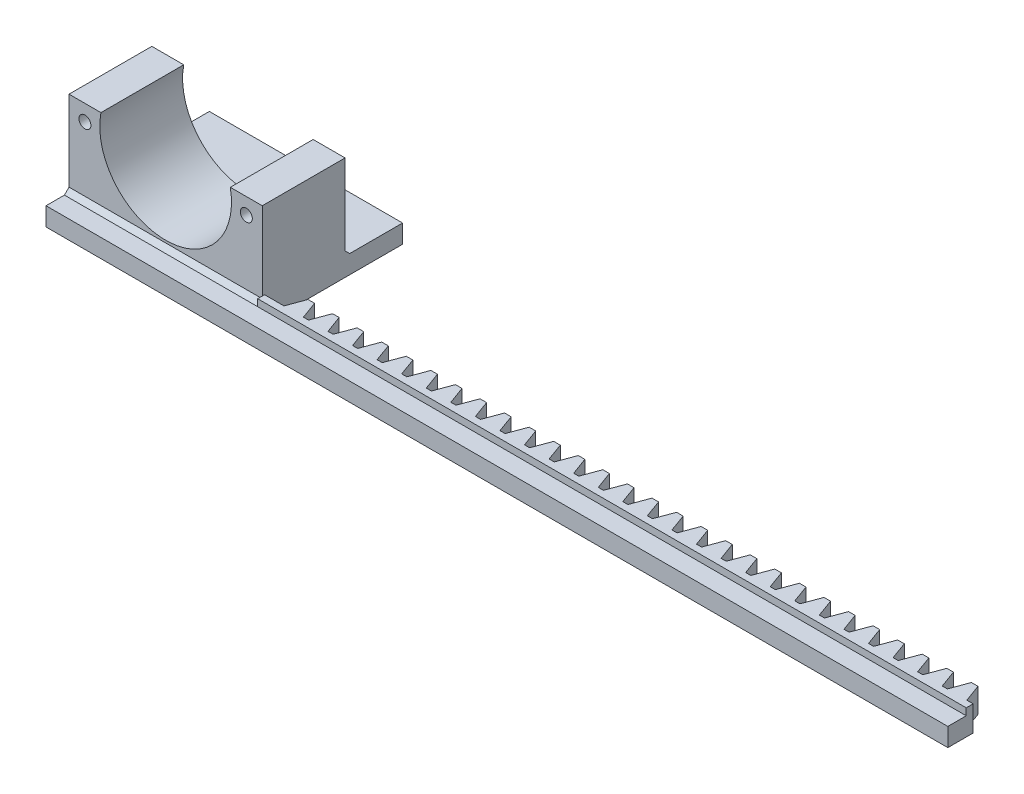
from build123d import *

# Parameters (mm, degrees)
BOSS_EXTRUDE1_DEPTH = 2.64
SKETCH2_W           = 154
SKETCH2_H           = 1.5
BOSS_EXTRUDE2_DEPTH = 0.22
SKETCH3_W           = 4
SKETCH3_H           = 4
BOSS_EXTRUDE3_DEPTH = 154
SKETCH4_W           = 42
SKETCH4_H           = 35.5
BOSS_EXTRUDE4_DEPTH = 4
SKETCH6_W           = 42
SKETCH6_H           = 18
BOSS_EXTRUDE5_DEPTH = 18.5
SKETCH7_R           = 14.314223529
CUT_EXTRUDE1_DEPTH  = 18.5
BOSS_EXTRUDE6_START = -42
BOSS_EXTRUDE6_DEPTH = 42
SKETCH9_R           = 1.3
CUT_EXTRUDE2_DEPTH  = 18.5


with BuildPart() as part:
    # Sketch1 → Boss-Extrude1 (new, symmetric)
    with BuildSketch(Plane(origin=(0, 0, 0), x_dir=(1, 0, 0), z_dir=(0, 1, 0))):
        Polygon((25, 1.7), (23.567498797, 1.7), (22.161556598, -2.125), (17.948749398, -2.125), (17.948749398, -3.625), (171.948749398, -3.625), (171.948749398, -2.125), (170.572186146, -2.125), (169.18, 1.7), (167.747498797, 1.7), (166.341556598, -2.125), (165.232186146, -2.125), (163.84, 1.7), (162.407498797, 1.7), (161.001556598, -2.125), (159.892186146, -2.125), (158.5, 1.7), (157.067498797, 1.7), (155.661556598, -2.125), (154.552186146, -2.125), (153.16, 1.7), (151.727498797, 1.7), (150.321556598, -2.125), (149.212186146, -2.125), (147.82, 1.7), (146.387498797, 1.7), (144.981556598, -2.125), (143.872186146, -2.125), (142.48, 1.7), (141.047498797, 1.7), (139.641556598, -2.125), (138.532186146, -2.125), (137.14, 1.7), (135.707498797, 1.7), (134.301556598, -2.125), (133.192186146, -2.125), (131.8, 1.7), (130.367498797, 1.7), (128.961556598, -2.125), (127.852186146, -2.125), (126.46, 1.7), (125.027498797, 1.7), (123.621556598, -2.125), (122.512186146, -2.125), (121.12, 1.7), (119.687498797, 1.7), (118.281556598, -2.125), (117.172186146, -2.125), (115.78, 1.7), (114.347498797, 1.7), (112.941556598, -2.125), (111.832186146, -2.125), (110.44, 1.7), (109.007498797, 1.7), (107.601556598, -2.125), (106.492186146, -2.125), (105.1, 1.7), (103.667498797, 1.7), (102.261556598, -2.125), (101.152186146, -2.125), (99.76, 1.7), (98.327498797, 1.7), (96.921556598, -2.125), (95.812186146, -2.125), (94.42, 1.7), (92.987498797, 1.7), (91.581556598, -2.125), (90.472186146, -2.125), (89.08, 1.7), (87.647498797, 1.7), (86.241556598, -2.125), (85.132186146, -2.125), (83.74, 1.7), (82.307498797, 1.7), (80.901556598, -2.125), (79.792186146, -2.125), (78.4, 1.7), (76.967498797, 1.7), (75.561556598, -2.125), (74.452186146, -2.125), (73.06, 1.7), (71.627498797, 1.7), (70.221556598, -2.125), (69.112186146, -2.125), (67.72, 1.7), (66.287498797, 1.7), (64.881556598, -2.125), (63.772186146, -2.125), (62.38, 1.7), (60.947498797, 1.7), (59.541556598, -2.125), (58.432186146, -2.125), (57.04, 1.7), (55.607498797, 1.7), (54.201556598, -2.125), (53.092186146, -2.125), (51.7, 1.7), (50.267498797, 1.7), (48.861556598, -2.125), (47.752186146, -2.125), (46.36, 1.7), (44.927498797, 1.7), (43.521556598, -2.125), (42.412186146, -2.125), (41.02, 1.7), (39.587498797, 1.7), (38.181556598, -2.125), (37.072186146, -2.125), (35.68, 1.7), (34.247498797, 1.7), (32.841556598, -2.125), (31.732186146, -2.125), (30.34, 1.7), (28.907498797, 1.7), (27.501556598, -2.125), (26.392186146, -2.125), align=None)
    extrude(amount=BOSS_EXTRUDE1_DEPTH, both=True)

    # Sketch2 → Boss-Extrude2 (add)
    with BuildSketch(Plane.XZ.offset(2.64)):
        with Locations((94.948749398, 2.875)):
            Rectangle(SKETCH2_W, SKETCH2_H)
    extrude(amount=BOSS_EXTRUDE2_DEPTH)

    # Sketch3 → Boss-Extrude3 (add)
    with BuildSketch(Plane(origin=(171.948749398, 0, 0), x_dir=(0, 0, -1), z_dir=(1, 0, 0))):
        with Locations((-5.625, -0.86)):
            Rectangle(SKETCH3_W, SKETCH3_H)
    extrude(amount=-BOSS_EXTRUDE3_DEPTH)

    # Sketch4 → Boss-Extrude4 (add)
    with BuildSketch(Plane.XZ.offset(2.86)):
        with Locations((-3.051250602, -10.125)):
            Rectangle(SKETCH4_W, SKETCH4_H)
    extrude(amount=-BOSS_EXTRUDE4_DEPTH)

    # Sketch6 → Boss-Extrude5 (add)
    with BuildSketch(Plane(origin=(0, 1.14, 0), x_dir=(1, 0, 0), z_dir=(0, 1, 0))):
        with Locations((-3.051250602, 6.375)):
            Rectangle(SKETCH6_W, SKETCH6_H)
    extrude(amount=BOSS_EXTRUDE5_DEPTH)

    # Sketch7 → Cut-Extrude1 (cut)
    with BuildSketch(Plane.XY.offset(2.625)):
        with Locations((-3.051250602, 16.954223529)):
            Circle(SKETCH7_R)
    extrude(amount=-CUT_EXTRUDE1_DEPTH, mode=Mode.SUBTRACT)

    # Sketch8 → Boss-Extrude6 (add)
    with BuildSketch(Plane.ZY.offset(24.051250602).offset(BOSS_EXTRUDE6_START)):
        Polygon((-16.375, 1.14), (-15.375, 2.14), (-15.375, 1.14), align=None)
        Polygon((2.625, 2.14), (3.625, 1.14), (2.625, 1.14), align=None)
    extrude(amount=BOSS_EXTRUDE6_DEPTH)

    # Sketch9 → Cut-Extrude2 (cut)
    with BuildSketch(Plane.XY.offset(2.625)):
        with Locations((-20.591250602, 16.14)):
            Circle(SKETCH9_R)
        with Locations((14.488749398, 16.14)):
            Circle(SKETCH9_R)
    extrude(amount=-CUT_EXTRUDE2_DEPTH, mode=Mode.SUBTRACT)


solid = part.part
